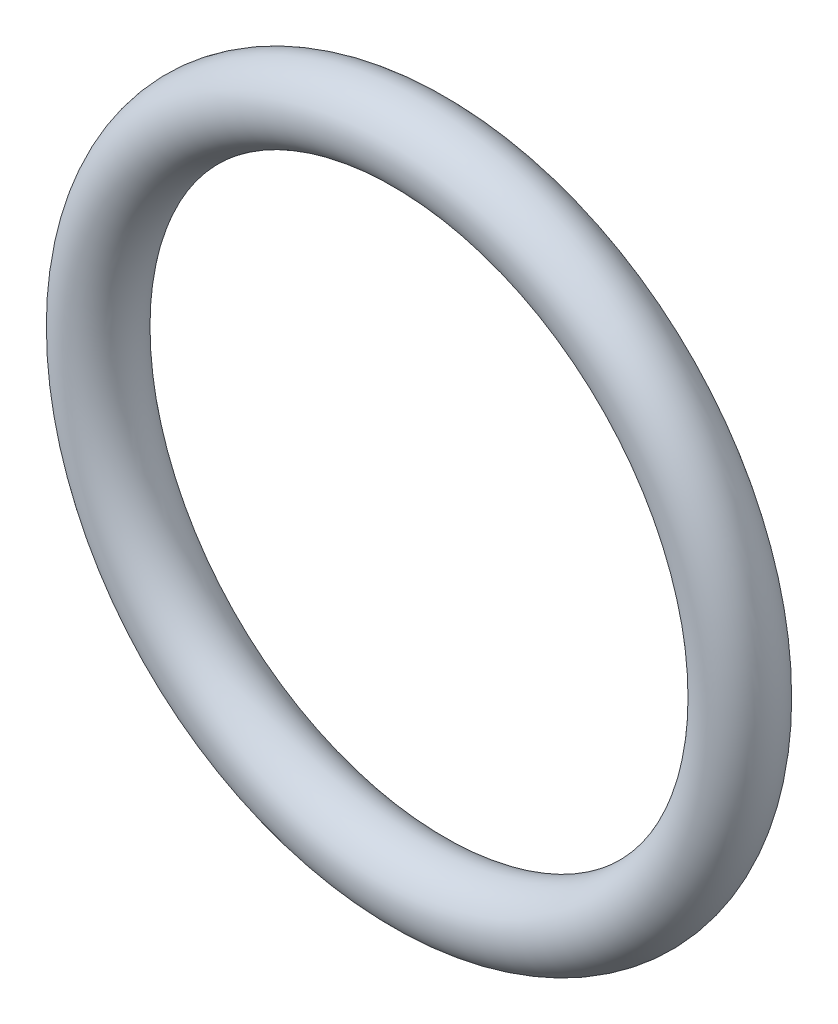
ISO-10303-21;
HEADER;
FILE_DESCRIPTION(('STEP AP214'),'2;1');
FILE_NAME('part.step','',(''),(''),'','','');
FILE_SCHEMA(('AUTOMOTIVE_DESIGN { 1 0 10303 214 1 1 1 1 }'));
ENDSEC;
DATA;
#1=APPLICATION_CONTEXT('core data for automotive mechanical design processes');
#2=APPLICATION_PROTOCOL_DEFINITION('international standard','automotive_design',2000,#1);
#3=PRODUCT_CONTEXT('',#1,'mechanical');
#4=PRODUCT('Part','Part','',(#3));
#5=PRODUCT_RELATED_PRODUCT_CATEGORY('part','',(#4));
#6=PRODUCT_DEFINITION_FORMATION('','',#4);
#7=PRODUCT_DEFINITION_CONTEXT('part definition',#1,'design');
#8=PRODUCT_DEFINITION('design','',#6,#7);
#9=PRODUCT_DEFINITION_SHAPE('','',#8);
#10=(LENGTH_UNIT() NAMED_UNIT(*) SI_UNIT(.MILLI.,.METRE.));
#11=(NAMED_UNIT(*) PLANE_ANGLE_UNIT() SI_UNIT($,.RADIAN.));
#12=(NAMED_UNIT(*) SI_UNIT($,.STERADIAN.) SOLID_ANGLE_UNIT());
#13=UNCERTAINTY_MEASURE_WITH_UNIT(LENGTH_MEASURE(1.E-05),#10,'distance_accuracy_value','');
#14=(GEOMETRIC_REPRESENTATION_CONTEXT(3) GLOBAL_UNCERTAINTY_ASSIGNED_CONTEXT((#13)) GLOBAL_UNIT_ASSIGNED_CONTEXT((#10,
#11,#12)) REPRESENTATION_CONTEXT('',''));
#15=CARTESIAN_POINT('',(0.,0.,0.));
#16=DIRECTION('',(0.,0.,1.));
#17=DIRECTION('',(1.,0.,0.));
#18=AXIS2_PLACEMENT_3D('',#15,#16,#17);
#19=CARTESIAN_POINT('',(0.,0.,2.75000000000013));
#20=DIRECTION('',(0.,0.,1.));
#21=DIRECTION('',(1.,0.,0.));
#22=AXIS2_PLACEMENT_3D('',#19,#20,#21);
#23=TOROIDAL_SURFACE('',#22,8.75000000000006,0.999999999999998);
#24=CARTESIAN_POINT('',(9.75000000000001,0.,2.75000000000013));
#25=VERTEX_POINT('',#24);
#26=VERTEX_LOOP('',#25);
#27=FACE_BOUND('',#26,.T.);
#28=ADVANCED_FACE('F26',(#27),#23,.T.);
#29=CLOSED_SHELL('',(#28));
#30=MANIFOLD_SOLID_BREP('B2',#29);
#31=ADVANCED_BREP_SHAPE_REPRESENTATION('',(#18,#30),#14);
#32=SHAPE_DEFINITION_REPRESENTATION(#9,#31);
ENDSEC;
END-ISO-10303-21;
